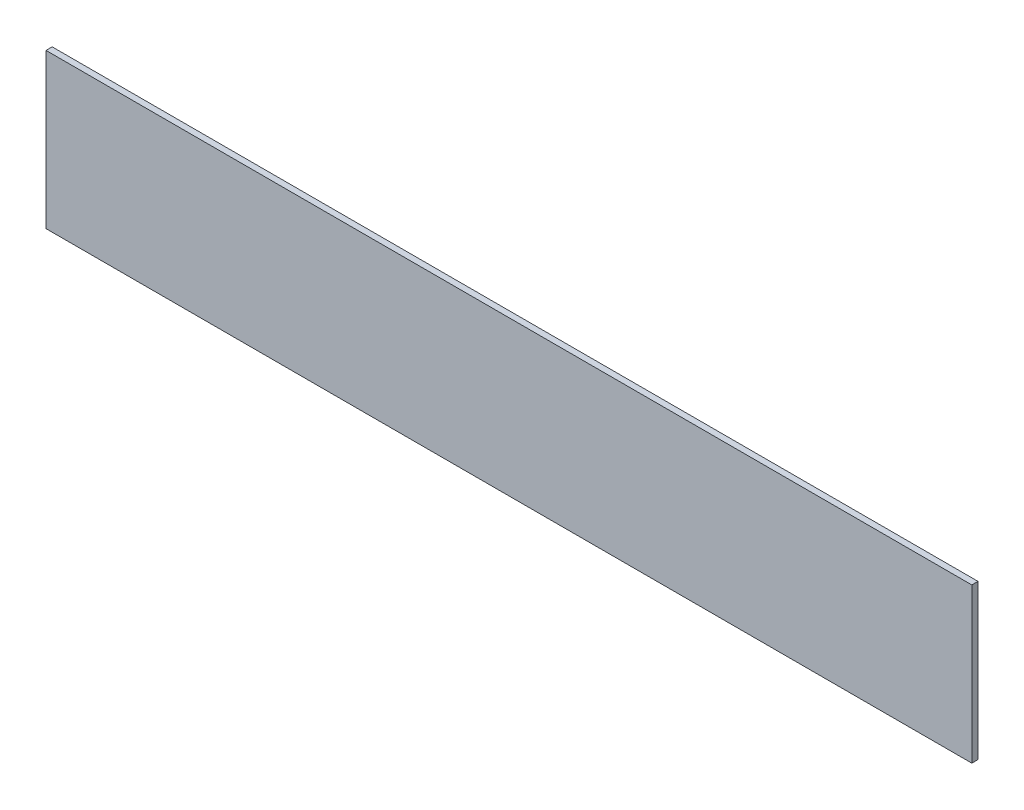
ISO-10303-21;
HEADER;
FILE_DESCRIPTION(('STEP AP214'),'2;1');
FILE_NAME('part.step','',(''),(''),'','','');
FILE_SCHEMA(('AUTOMOTIVE_DESIGN { 1 0 10303 214 1 1 1 1 }'));
ENDSEC;
DATA;
#1=APPLICATION_CONTEXT('core data for automotive mechanical design processes');
#2=APPLICATION_PROTOCOL_DEFINITION('international standard','automotive_design',2000,#1);
#3=PRODUCT_CONTEXT('',#1,'mechanical');
#4=PRODUCT('Part','Part','',(#3));
#5=PRODUCT_RELATED_PRODUCT_CATEGORY('part','',(#4));
#6=PRODUCT_DEFINITION_FORMATION('','',#4);
#7=PRODUCT_DEFINITION_CONTEXT('part definition',#1,'design');
#8=PRODUCT_DEFINITION('design','',#6,#7);
#9=PRODUCT_DEFINITION_SHAPE('','',#8);
#10=(LENGTH_UNIT() NAMED_UNIT(*) SI_UNIT(.MILLI.,.METRE.));
#11=(NAMED_UNIT(*) PLANE_ANGLE_UNIT() SI_UNIT($,.RADIAN.));
#12=(NAMED_UNIT(*) SI_UNIT($,.STERADIAN.) SOLID_ANGLE_UNIT());
#13=UNCERTAINTY_MEASURE_WITH_UNIT(LENGTH_MEASURE(1.E-05),#10,'distance_accuracy_value','');
#14=(GEOMETRIC_REPRESENTATION_CONTEXT(3) GLOBAL_UNCERTAINTY_ASSIGNED_CONTEXT((#13)) GLOBAL_UNIT_ASSIGNED_CONTEXT((#10,
#11,#12)) REPRESENTATION_CONTEXT('',''));
#15=CARTESIAN_POINT('',(0.,0.,0.));
#16=DIRECTION('',(0.,0.,1.));
#17=DIRECTION('',(1.,0.,0.));
#18=AXIS2_PLACEMENT_3D('',#15,#16,#17);
#19=CARTESIAN_POINT('',(-599.749999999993,409.632531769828,4.));
#20=DIRECTION('',(1.,0.,0.));
#21=DIRECTION('',(0.,0.,-1.));
#22=AXIS2_PLACEMENT_3D('',#19,#20,#21);
#23=PLANE('',#22);
#24=DIRECTION('',(0.,-1.,0.));
#25=VECTOR('',#24,1.);
#26=CARTESIAN_POINT('',(-599.749999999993,409.632531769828,0.));
#27=LINE('',#26,#25);
#28=CARTESIAN_POINT('',(-599.749999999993,409.632531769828,0.));
#29=VERTEX_POINT('',#28);
#30=CARTESIAN_POINT('',(-599.749999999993,309.632531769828,0.));
#31=VERTEX_POINT('',#30);
#32=EDGE_CURVE('E96',#29,#31,#27,.T.);
#33=ORIENTED_EDGE('',*,*,#32,.T.);
#34=DIRECTION('',(0.,0.,-1.));
#35=VECTOR('',#34,1.);
#36=CARTESIAN_POINT('',(-599.749999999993,309.632531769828,4.));
#37=LINE('',#36,#35);
#38=CARTESIAN_POINT('',(-599.749999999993,309.632531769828,4.));
#39=VERTEX_POINT('',#38);
#40=EDGE_CURVE('E11',#39,#31,#37,.T.);
#41=ORIENTED_EDGE('',*,*,#40,.F.);
#42=DIRECTION('',(0.,-1.,0.));
#43=VECTOR('',#42,1.);
#44=CARTESIAN_POINT('',(-599.749999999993,409.632531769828,4.));
#45=LINE('',#44,#43);
#46=CARTESIAN_POINT('',(-599.749999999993,409.632531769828,4.));
#47=VERTEX_POINT('',#46);
#48=EDGE_CURVE('E84',#47,#39,#45,.T.);
#49=ORIENTED_EDGE('',*,*,#48,.F.);
#50=DIRECTION('',(0.,0.,-1.));
#51=VECTOR('',#50,1.);
#52=CARTESIAN_POINT('',(-599.749999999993,409.632531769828,4.));
#53=LINE('',#52,#51);
#54=EDGE_CURVE('E92',#47,#29,#53,.T.);
#55=ORIENTED_EDGE('',*,*,#54,.T.);
#56=EDGE_LOOP('',(#33,#41,#49,#55));
#57=FACE_BOUND('',#56,.T.);
#58=ADVANCED_FACE('F33',(#57),#23,.F.);
#59=CARTESIAN_POINT('',(-599.749999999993,309.632531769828,4.));
#60=DIRECTION('',(0.,1.,0.));
#61=DIRECTION('',(0.,0.,1.));
#62=AXIS2_PLACEMENT_3D('',#59,#60,#61);
#63=PLANE('',#62);
#64=DIRECTION('',(1.,0.,0.));
#65=VECTOR('',#64,1.);
#66=CARTESIAN_POINT('',(-599.749999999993,309.632531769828,0.));
#67=LINE('',#66,#65);
#68=CARTESIAN_POINT('',(-1.11022302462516E-13,309.632531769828,0.));
#69=VERTEX_POINT('',#68);
#70=EDGE_CURVE('E88',#31,#69,#67,.T.);
#71=ORIENTED_EDGE('',*,*,#70,.T.);
#72=DIRECTION('',(0.,0.,-1.));
#73=VECTOR('',#72,1.);
#74=CARTESIAN_POINT('',(-1.11022302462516E-13,309.632531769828,4.));
#75=LINE('',#74,#73);
#76=CARTESIAN_POINT('',(-1.11022302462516E-13,309.632531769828,4.));
#77=VERTEX_POINT('',#76);
#78=EDGE_CURVE('E41',#77,#69,#75,.T.);
#79=ORIENTED_EDGE('',*,*,#78,.F.);
#80=DIRECTION('',(1.,0.,0.));
#81=VECTOR('',#80,1.);
#82=CARTESIAN_POINT('',(-599.749999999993,309.632531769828,4.));
#83=LINE('',#82,#81);
#84=EDGE_CURVE('E79',#39,#77,#83,.T.);
#85=ORIENTED_EDGE('',*,*,#84,.F.);
#86=ORIENTED_EDGE('',*,*,#40,.T.);
#87=EDGE_LOOP('',(#71,#79,#85,#86));
#88=FACE_BOUND('',#87,.T.);
#89=ADVANCED_FACE('F87',(#88),#63,.F.);
#90=CARTESIAN_POINT('',(-1.11022302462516E-13,409.632531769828,4.));
#91=DIRECTION('',(-1.,0.,0.));
#92=DIRECTION('',(0.,0.,1.));
#93=AXIS2_PLACEMENT_3D('',#90,#91,#92);
#94=PLANE('',#93);
#95=DIRECTION('',(0.,1.,0.));
#96=VECTOR('',#95,1.);
#97=CARTESIAN_POINT('',(-1.11022302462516E-13,409.632531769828,0.));
#98=LINE('',#97,#96);
#99=CARTESIAN_POINT('',(-1.11022302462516E-13,409.632531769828,0.));
#100=VERTEX_POINT('',#99);
#101=EDGE_CURVE('E66',#69,#100,#98,.T.);
#102=ORIENTED_EDGE('',*,*,#101,.T.);
#103=DIRECTION('',(0.,0.,-1.));
#104=VECTOR('',#103,1.);
#105=CARTESIAN_POINT('',(-1.11022302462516E-13,409.632531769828,4.));
#106=LINE('',#105,#104);
#107=CARTESIAN_POINT('',(-1.11022302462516E-13,409.632531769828,4.));
#108=VERTEX_POINT('',#107);
#109=EDGE_CURVE('E89',#108,#100,#106,.T.);
#110=ORIENTED_EDGE('',*,*,#109,.F.);
#111=DIRECTION('',(0.,1.,0.));
#112=VECTOR('',#111,1.);
#113=CARTESIAN_POINT('',(-1.11022302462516E-13,409.632531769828,4.));
#114=LINE('',#113,#112);
#115=EDGE_CURVE('E82',#77,#108,#114,.T.);
#116=ORIENTED_EDGE('',*,*,#115,.F.);
#117=ORIENTED_EDGE('',*,*,#78,.T.);
#118=EDGE_LOOP('',(#102,#110,#116,#117));
#119=FACE_BOUND('',#118,.T.);
#120=ADVANCED_FACE('F90',(#119),#94,.F.);
#121=CARTESIAN_POINT('',(-599.749999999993,409.632531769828,4.));
#122=DIRECTION('',(0.,-1.,0.));
#123=DIRECTION('',(0.,0.,-1.));
#124=AXIS2_PLACEMENT_3D('',#121,#122,#123);
#125=PLANE('',#124);
#126=DIRECTION('',(-1.,0.,0.));
#127=VECTOR('',#126,1.);
#128=CARTESIAN_POINT('',(-599.749999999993,409.632531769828,0.));
#129=LINE('',#128,#127);
#130=EDGE_CURVE('E72',#100,#29,#129,.T.);
#131=ORIENTED_EDGE('',*,*,#130,.T.);
#132=ORIENTED_EDGE('',*,*,#54,.F.);
#133=DIRECTION('',(-1.,0.,0.));
#134=VECTOR('',#133,1.);
#135=CARTESIAN_POINT('',(-599.749999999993,409.632531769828,4.));
#136=LINE('',#135,#134);
#137=EDGE_CURVE('E49',#108,#47,#136,.T.);
#138=ORIENTED_EDGE('',*,*,#137,.F.);
#139=ORIENTED_EDGE('',*,*,#109,.T.);
#140=EDGE_LOOP('',(#131,#132,#138,#139));
#141=FACE_BOUND('',#140,.T.);
#142=ADVANCED_FACE('F103',(#141),#125,.F.);
#143=CARTESIAN_POINT('',(0.,0.,4.));
#144=DIRECTION('',(0.,0.,1.));
#145=DIRECTION('',(1.,0.,0.));
#146=AXIS2_PLACEMENT_3D('',#143,#144,#145);
#147=PLANE('',#146);
#148=ORIENTED_EDGE('',*,*,#48,.T.);
#149=ORIENTED_EDGE('',*,*,#84,.T.);
#150=ORIENTED_EDGE('',*,*,#115,.T.);
#151=ORIENTED_EDGE('',*,*,#137,.T.);
#152=EDGE_LOOP('',(#148,#149,#150,#151));
#153=FACE_BOUND('',#152,.T.);
#154=ADVANCED_FACE('F80',(#153),#147,.T.);
#155=CARTESIAN_POINT('',(0.,0.,0.));
#156=DIRECTION('',(0.,0.,1.));
#157=DIRECTION('',(1.,0.,0.));
#158=AXIS2_PLACEMENT_3D('',#155,#156,#157);
#159=PLANE('',#158);
#160=ORIENTED_EDGE('',*,*,#32,.F.);
#161=ORIENTED_EDGE('',*,*,#130,.F.);
#162=ORIENTED_EDGE('',*,*,#101,.F.);
#163=ORIENTED_EDGE('',*,*,#70,.F.);
#164=EDGE_LOOP('',(#160,#161,#162,#163));
#165=FACE_BOUND('',#164,.T.);
#166=ADVANCED_FACE('F106',(#165),#159,.F.);
#167=CLOSED_SHELL('',(#58,#89,#120,#142,#154,#166));
#168=MANIFOLD_SOLID_BREP('B2',#167);
#169=ADVANCED_BREP_SHAPE_REPRESENTATION('',(#18,#168),#14);
#170=SHAPE_DEFINITION_REPRESENTATION(#9,#169);
ENDSEC;
END-ISO-10303-21;
